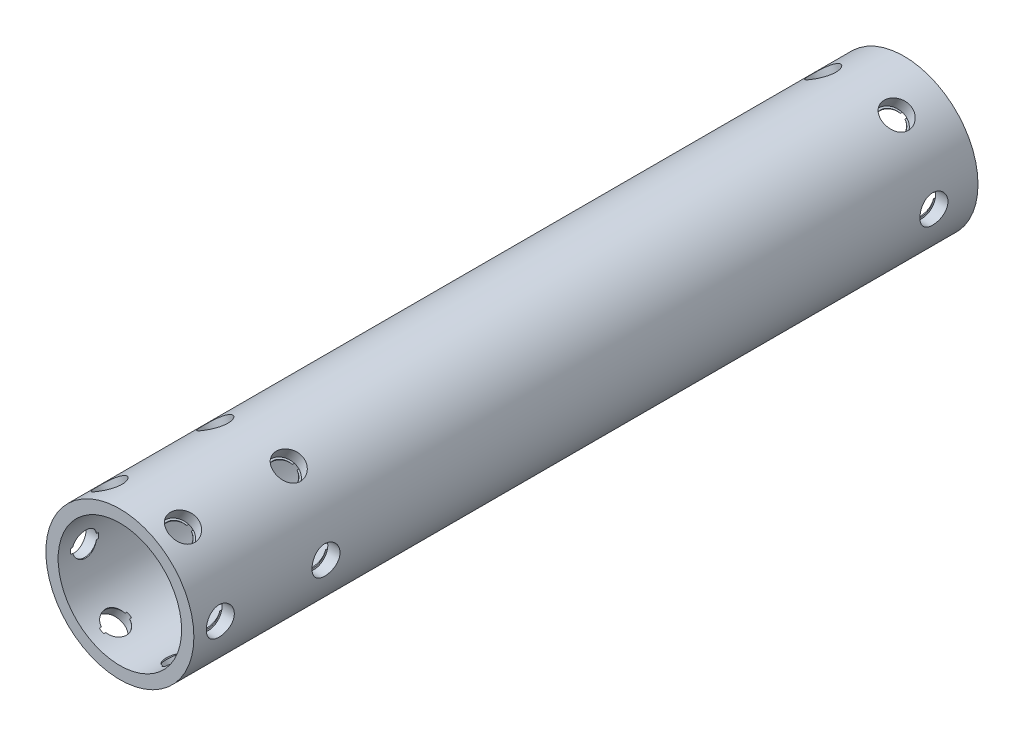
from build123d import *

# Parameters (mm, degrees)
SKETCH1_R                    = 13.335
SKETCH1_R_2                  = 11.1252
EXTRUDE1_DEPTH               = 70.64375
SKETCH10_R                   = 2.1844
CUT_EXTRUDE1_DEPTH           = 5.08
SKETCH12_W                   = 2.825501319
SKETCH12_H                   = 2.5273
LPATTERN1_COUNT              = 2
LPATTERN1_PITCH              = 19.05
LPATTERN1_COL_COUNT          = 2
LPATTERN1_COL_PITCH          = 109.5375
CIRPATTERN2_COUNT            = 6
CIRPATTERN2_COPY_1_SKETCH_R  = 2.1844
CIRPATTERN2_COPY_1_DEPTH     = 5.08
CIRPATTERN2_COPY_2_SKETCH_R  = 2.1844
CIRPATTERN2_COPY_2_DEPTH     = 5.08
CIRPATTERN2_COPY_3_SKETCH_R  = 2.1844
CIRPATTERN2_COPY_3_DEPTH     = 5.08
CIRPATTERN2_COPY_4_SKETCH_R  = 2.1844
CIRPATTERN2_COPY_4_DEPTH     = 5.08
CIRPATTERN2_COPY_5_SKETCH_R  = 2.1844
CIRPATTERN2_COPY_5_DEPTH     = 5.08
CIRPATTERN2_COPY_6_SKETCH_W  = 2.825501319
CIRPATTERN2_COPY_6_SKETCH_H  = 2.5273
CIRPATTERN2_COPY_7_SKETCH_W  = 2.825501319
CIRPATTERN2_COPY_7_SKETCH_H  = 2.5273
CIRPATTERN2_COPY_8_SKETCH_W  = 2.825501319
CIRPATTERN2_COPY_8_SKETCH_H  = 2.5273
CIRPATTERN2_COPY_9_SKETCH_W  = 2.825501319
CIRPATTERN2_COPY_9_SKETCH_H  = 2.5273
CIRPATTERN2_COPY_10_SKETCH_W = 2.825501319
CIRPATTERN2_COPY_10_SKETCH_H = 2.5273
CIRPATTERN2_COPY_11_SKETCH_R = 2.1844
CIRPATTERN2_COPY_11_DEPTH    = 5.08
CIRPATTERN2_COPY_12_SKETCH_R = 2.1844
CIRPATTERN2_COPY_12_DEPTH    = 5.08
CIRPATTERN2_COPY_13_SKETCH_R = 2.1844
CIRPATTERN2_COPY_13_DEPTH    = 5.08
CIRPATTERN2_COPY_14_SKETCH_R = 2.1844
CIRPATTERN2_COPY_14_DEPTH    = 5.08
CIRPATTERN2_COPY_15_SKETCH_R = 2.1844
CIRPATTERN2_COPY_15_DEPTH    = 5.08
CIRPATTERN2_COPY_16_SKETCH_W = 2.825501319
CIRPATTERN2_COPY_16_SKETCH_H = 2.5273
CIRPATTERN2_COPY_17_SKETCH_W = 2.825501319
CIRPATTERN2_COPY_17_SKETCH_H = 2.5273
CIRPATTERN2_COPY_18_SKETCH_W = 2.825501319
CIRPATTERN2_COPY_18_SKETCH_H = 2.5273
CIRPATTERN2_COPY_19_SKETCH_W = 2.825501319
CIRPATTERN2_COPY_19_SKETCH_H = 2.5273
CIRPATTERN2_COPY_20_SKETCH_W = 2.825501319
CIRPATTERN2_COPY_20_SKETCH_H = 2.5273


with BuildPart() as part:
    # Sketch1 → Extrude1 (new, symmetric)
    with BuildSketch(Plane.XY):
        Circle(SKETCH1_R)
        Circle(SKETCH1_R_2, mode=Mode.SUBTRACT)
    extrude(amount=EXTRUDE1_DEPTH, both=True)

    # Sketch10 → Cut-Extrude1 (cut)
    with BuildSketch(Plane(origin=(13.335, 0, 0), x_dir=(0, 0, -1), z_dir=(1, 0, 0))):
        with Locations((-46.83125, 0)):
            Circle(SKETCH10_R)
    cut_extrude1 = extrude(amount=-CUT_EXTRUDE1_DEPTH, mode=Mode.SUBTRACT)

    # Sketch12 → Cut-Revolve13 (revolve, cut)
    with BuildSketch(Plane.XY.offset(46.83125), mode=Mode.PRIVATE) as cut_revolve13_sk:
        with Locations((12.52779066, 1.26365)):
            Rectangle(SKETCH12_W, SKETCH12_H)
    cut_revolve13 = revolve(cut_revolve13_sk.sketch.rotate(Axis((0, 0, 46.83125), (1, 0, 0)), 90), axis=Axis((0, 0, 46.83125), (1, 0, 0)), mode=Mode.SUBTRACT)

    # LPattern1: Cut-Extrude1, Cut-Revolve13 ×2
    with Locations(*[(0, 0, i * LPATTERN1_PITCH) for i in range(1, LPATTERN1_COUNT)]):
        add(cut_extrude1, mode=Mode.SUBTRACT)
        add(cut_revolve13, mode=Mode.SUBTRACT)

    # LPattern1 col: Cut-Extrude1, Cut-Revolve13 ×2
    with Locations(*[(0, 0, -i * LPATTERN1_COL_PITCH) for i in range(1, LPATTERN1_COL_COUNT)]):
        add(cut_extrude1, mode=Mode.SUBTRACT)
        add(cut_revolve13, mode=Mode.SUBTRACT)

    # CirPattern2: Cut-Extrude1, Cut-Revolve13 ×6 about axis
    cirpattern2_axis = Axis((0, 0, 0), (0, 0, 1))
    add([cut_extrude1.rotate(cirpattern2_axis, i * 360 / CIRPATTERN2_COUNT) for i in range(1, CIRPATTERN2_COUNT)], mode=Mode.SUBTRACT)
    add([cut_revolve13.rotate(cirpattern2_axis, i * 360 / CIRPATTERN2_COUNT) for i in range(1, CIRPATTERN2_COUNT)], mode=Mode.SUBTRACT)

    # CirPattern2 copy 1 sketch → CirPattern2 copy 1 (cut)
    with BuildSketch(Plane(origin=(6.6675, 11.548448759, 19.05), x_dir=(0, 0, -1), z_dir=(0.5000000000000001, 0.8660254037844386, 0))):
        with Locations((-46.83125, 0)):
            Circle(CIRPATTERN2_COPY_1_SKETCH_R)
    extrude(amount=-CIRPATTERN2_COPY_1_DEPTH, mode=Mode.SUBTRACT)

    # CirPattern2 copy 2 sketch → CirPattern2 copy 2 (cut)
    with BuildSketch(Plane(origin=(-6.6675, 11.548448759, 19.05), x_dir=(0, 0, -1), z_dir=(-0.4999999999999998, 0.8660254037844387, 0))):
        with Locations((-46.83125, 0)):
            Circle(CIRPATTERN2_COPY_2_SKETCH_R)
    extrude(amount=-CIRPATTERN2_COPY_2_DEPTH, mode=Mode.SUBTRACT)

    # CirPattern2 copy 3 sketch → CirPattern2 copy 3 (cut)
    with BuildSketch(Plane(origin=(-13.335, 0, 19.05), x_dir=(0, 0, -1), z_dir=(-1, 0, 0))):
        with Locations((-46.83125, 0)):
            Circle(CIRPATTERN2_COPY_3_SKETCH_R)
    extrude(amount=-CIRPATTERN2_COPY_3_DEPTH, mode=Mode.SUBTRACT)

    # CirPattern2 copy 4 sketch → CirPattern2 copy 4 (cut)
    with BuildSketch(Plane(origin=(-6.6675, -11.548448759, 19.05), x_dir=(0, 0, -1), z_dir=(-0.5000000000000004, -0.8660254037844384, 0))):
        with Locations((-46.83125, 0)):
            Circle(CIRPATTERN2_COPY_4_SKETCH_R)
    extrude(amount=-CIRPATTERN2_COPY_4_DEPTH, mode=Mode.SUBTRACT)

    # CirPattern2 copy 5 sketch → CirPattern2 copy 5 (cut)
    with BuildSketch(Plane(origin=(6.6675, -11.548448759, 19.05), x_dir=(0, 0, -1), z_dir=(0.5000000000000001, -0.8660254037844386, 0))):
        with Locations((-46.83125, 0)):
            Circle(CIRPATTERN2_COPY_5_SKETCH_R)
    extrude(amount=-CIRPATTERN2_COPY_5_DEPTH, mode=Mode.SUBTRACT)

    # CirPattern2 copy 6 sketch → CirPattern2 copy 6 (revolve, cut)
    with BuildSketch(Plane(origin=(0, 0, 65.88125), x_dir=(0.5000000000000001, 0.8660254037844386, 0), z_dir=(0, 0, 1))):
        with Locations((12.52779066, 1.26365)):
            Rectangle(CIRPATTERN2_COPY_6_SKETCH_W, CIRPATTERN2_COPY_6_SKETCH_H)
    revolve(axis=Axis((0, 0, 65.88125), (0.5000000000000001, 0.8660254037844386, 0)), mode=Mode.SUBTRACT)

    # CirPattern2 copy 7 sketch → CirPattern2 copy 7 (revolve, cut)
    with BuildSketch(Plane(origin=(0, 0, 65.88125), x_dir=(-0.4999999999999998, 0.8660254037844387, 0), z_dir=(0, 0, 1))):
        with Locations((12.52779066, 1.26365)):
            Rectangle(CIRPATTERN2_COPY_7_SKETCH_W, CIRPATTERN2_COPY_7_SKETCH_H)
    revolve(axis=Axis((0, 0, 65.88125), (-0.4999999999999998, 0.8660254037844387, 0)), mode=Mode.SUBTRACT)

    # CirPattern2 copy 8 sketch → CirPattern2 copy 8 (revolve, cut)
    with BuildSketch(Plane(origin=(0, 0, 65.88125), x_dir=(-1, 0, 0), z_dir=(0, 0, 1))):
        with Locations((12.52779066, 1.26365)):
            Rectangle(CIRPATTERN2_COPY_8_SKETCH_W, CIRPATTERN2_COPY_8_SKETCH_H)
    revolve(axis=Axis((0, 0, 65.88125), (-1, 0, 0)), mode=Mode.SUBTRACT)

    # CirPattern2 copy 9 sketch → CirPattern2 copy 9 (revolve, cut)
    with BuildSketch(Plane(origin=(0, 0, 65.88125), x_dir=(-0.5000000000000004, -0.8660254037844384, 0), z_dir=(0, 0, 1))):
        with Locations((12.52779066, 1.26365)):
            Rectangle(CIRPATTERN2_COPY_9_SKETCH_W, CIRPATTERN2_COPY_9_SKETCH_H)
    revolve(axis=Axis((0, 0, 65.88125), (-0.5000000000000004, -0.8660254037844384, 0)), mode=Mode.SUBTRACT)

    # CirPattern2 copy 10 sketch → CirPattern2 copy 10 (revolve, cut)
    with BuildSketch(Plane(origin=(0, 0, 65.88125), x_dir=(0.5000000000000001, -0.8660254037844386, 0), z_dir=(0, 0, 1))):
        with Locations((12.52779066, 1.26365)):
            Rectangle(CIRPATTERN2_COPY_10_SKETCH_W, CIRPATTERN2_COPY_10_SKETCH_H)
    revolve(axis=Axis((0, 0, 65.88125), (0.5000000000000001, -0.8660254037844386, 0)), mode=Mode.SUBTRACT)

    # CirPattern2 copy 11 sketch → CirPattern2 copy 11 (cut)
    with BuildSketch(Plane(origin=(6.6675, 11.548448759, -109.5375), x_dir=(0, 0, -1), z_dir=(0.5000000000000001, 0.8660254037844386, 0))):
        with Locations((-46.83125, 0)):
            Circle(CIRPATTERN2_COPY_11_SKETCH_R)
    extrude(amount=-CIRPATTERN2_COPY_11_DEPTH, mode=Mode.SUBTRACT)

    # CirPattern2 copy 12 sketch → CirPattern2 copy 12 (cut)
    with BuildSketch(Plane(origin=(-6.6675, 11.548448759, -109.5375), x_dir=(0, 0, -1), z_dir=(-0.4999999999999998, 0.8660254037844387, 0))):
        with Locations((-46.83125, 0)):
            Circle(CIRPATTERN2_COPY_12_SKETCH_R)
    extrude(amount=-CIRPATTERN2_COPY_12_DEPTH, mode=Mode.SUBTRACT)

    # CirPattern2 copy 13 sketch → CirPattern2 copy 13 (cut)
    with BuildSketch(Plane(origin=(-13.335, 0, -109.5375), x_dir=(0, 0, -1), z_dir=(-1, 0, 0))):
        with Locations((-46.83125, 0)):
            Circle(CIRPATTERN2_COPY_13_SKETCH_R)
    extrude(amount=-CIRPATTERN2_COPY_13_DEPTH, mode=Mode.SUBTRACT)

    # CirPattern2 copy 14 sketch → CirPattern2 copy 14 (cut)
    with BuildSketch(Plane(origin=(-6.6675, -11.548448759, -109.5375), x_dir=(0, 0, -1), z_dir=(-0.5000000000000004, -0.8660254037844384, 0))):
        with Locations((-46.83125, 0)):
            Circle(CIRPATTERN2_COPY_14_SKETCH_R)
    extrude(amount=-CIRPATTERN2_COPY_14_DEPTH, mode=Mode.SUBTRACT)

    # CirPattern2 copy 15 sketch → CirPattern2 copy 15 (cut)
    with BuildSketch(Plane(origin=(6.6675, -11.548448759, -109.5375), x_dir=(0, 0, -1), z_dir=(0.5000000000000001, -0.8660254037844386, 0))):
        with Locations((-46.83125, 0)):
            Circle(CIRPATTERN2_COPY_15_SKETCH_R)
    extrude(amount=-CIRPATTERN2_COPY_15_DEPTH, mode=Mode.SUBTRACT)

    # CirPattern2 copy 16 sketch → CirPattern2 copy 16 (revolve, cut)
    with BuildSketch(Plane(origin=(0, 0, -62.70625), x_dir=(0.5000000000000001, 0.8660254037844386, 0), z_dir=(0, 0, 1))):
        with Locations((12.52779066, 1.26365)):
            Rectangle(CIRPATTERN2_COPY_16_SKETCH_W, CIRPATTERN2_COPY_16_SKETCH_H)
    revolve(axis=Axis((0, 0, -62.70625), (0.5000000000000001, 0.8660254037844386, 0)), mode=Mode.SUBTRACT)

    # CirPattern2 copy 17 sketch → CirPattern2 copy 17 (revolve, cut)
    with BuildSketch(Plane(origin=(0, 0, -62.70625), x_dir=(-0.4999999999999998, 0.8660254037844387, 0), z_dir=(0, 0, 1))):
        with Locations((12.52779066, 1.26365)):
            Rectangle(CIRPATTERN2_COPY_17_SKETCH_W, CIRPATTERN2_COPY_17_SKETCH_H)
    revolve(axis=Axis((0, 0, -62.70625), (-0.4999999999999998, 0.8660254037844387, 0)), mode=Mode.SUBTRACT)

    # CirPattern2 copy 18 sketch → CirPattern2 copy 18 (revolve, cut)
    with BuildSketch(Plane(origin=(0, 0, -62.70625), x_dir=(-1, 0, 0), z_dir=(0, 0, 1))):
        with Locations((12.52779066, 1.26365)):
            Rectangle(CIRPATTERN2_COPY_18_SKETCH_W, CIRPATTERN2_COPY_18_SKETCH_H)
    revolve(axis=Axis((0, 0, -62.70625), (-1, 0, 0)), mode=Mode.SUBTRACT)

    # CirPattern2 copy 19 sketch → CirPattern2 copy 19 (revolve, cut)
    with BuildSketch(Plane(origin=(0, 0, -62.70625), x_dir=(-0.5000000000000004, -0.8660254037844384, 0), z_dir=(0, 0, 1))):
        with Locations((12.52779066, 1.26365)):
            Rectangle(CIRPATTERN2_COPY_19_SKETCH_W, CIRPATTERN2_COPY_19_SKETCH_H)
    revolve(axis=Axis((0, 0, -62.70625), (-0.5000000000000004, -0.8660254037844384, 0)), mode=Mode.SUBTRACT)

    # CirPattern2 copy 20 sketch → CirPattern2 copy 20 (revolve, cut)
    with BuildSketch(Plane(origin=(0, 0, -62.70625), x_dir=(0.5000000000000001, -0.8660254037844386, 0), z_dir=(0, 0, 1))):
        with Locations((12.52779066, 1.26365)):
            Rectangle(CIRPATTERN2_COPY_20_SKETCH_W, CIRPATTERN2_COPY_20_SKETCH_H)
    revolve(axis=Axis((0, 0, -62.70625), (0.5000000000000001, -0.8660254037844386, 0)), mode=Mode.SUBTRACT)


solid = part.part
